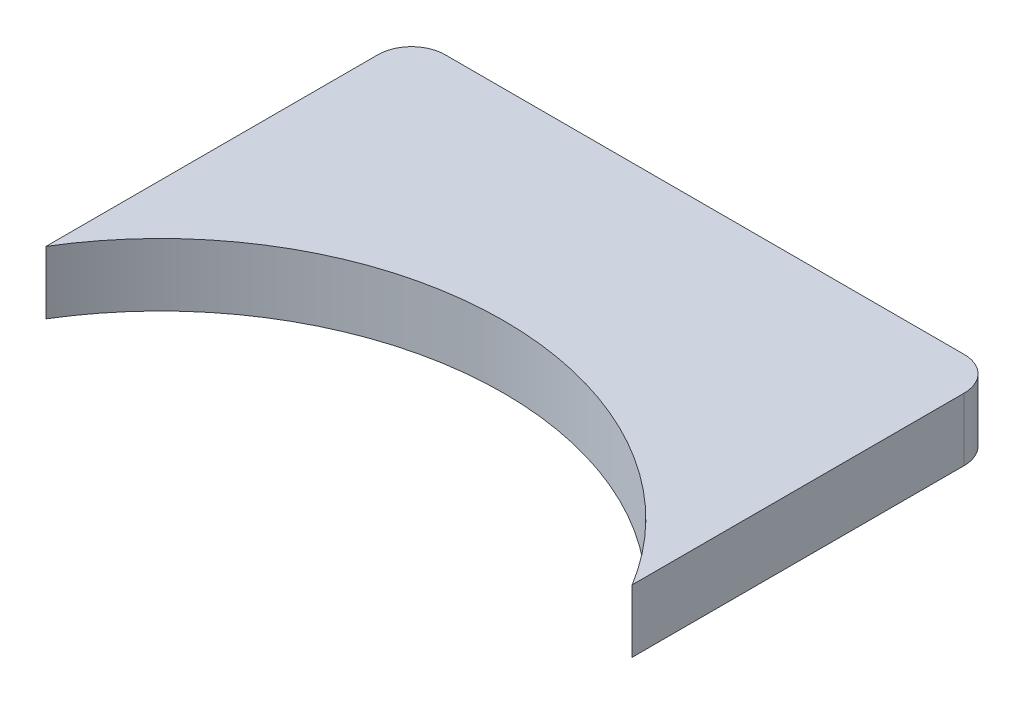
from build123d import *

# Parameters (mm, degrees)
BOSS_EXTRUDE1_DEPTH = 9.525


with BuildPart() as part:
    # Sketch1 → Boss-Extrude1 (new body)
    with BuildSketch(Plane(origin=(0, 0, 0), x_dir=(1, 0, 0), z_dir=(0, 1, 0))):
        with BuildLine():
            Line((-44.45, -10.98022124), (-44.45, 39.37))
            ThreePointArc((-44.45, 39.37), (-42.962102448, 42.962102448), (-39.37, 44.45))
            Line((-39.37, 44.45), (39.37, 44.45))
            ThreePointArc((39.37, 44.45), (42.962102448, 42.962102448), (44.45, 39.37))
            Line((44.45, 39.37), (44.45, -10.98022124))
            ThreePointArc((44.45, -10.98022124), (0, 13.97), (-44.45, -10.98022124))
        make_face()
    extrude(amount=BOSS_EXTRUDE1_DEPTH)


solid = part.part
